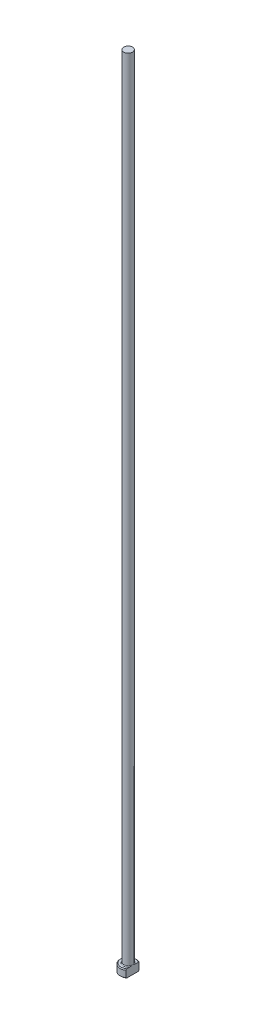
from build123d import *
from build123d.topology import SkipClean

# Parameters (mm, degrees)
CHAMFER1_SIZE = 0.2
FILLET1_R     = 0.2
KEY_DEPTH     = 201.019999


with BuildPart() as part:
    # Sketch1 → Revolve1 (revolve)
    with BuildSketch(Plane.XY, mode=Mode.PRIVATE) as revolve1_sk:
        Polygon((0, 0), (-2, 0), (-2, 2), (-1.1, 2), (-1.1, 200), (0, 200), align=None)
    revolve(revolve1_sk.sketch.rotate(Axis((0, 259.958771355, 0), (0, -1, 0)), 270), axis=Axis((0, 259.958771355, 0), (0, -1, 0)))

    # Chamfer1
    chamfer1_edges = [part.edges().sort_by_distance(p)[0] for p in [
        (0, 2, -2),
        (0, 0, -2),
    ]]
    chamfer(chamfer1_edges, length=CHAMFER1_SIZE)

    # Fillet1
    fillet1_edges = [part.edges().sort_by_distance(p)[0] for p in [
        (0, 2, -1.1),
    ]]
    fillet(fillet1_edges, radius=FILLET1_R)

    # Sketch2 → KEY (cut, through all)
    with SkipClean():  # the faces are left unmerged after this step: merging them gives an invalid solid
        with BuildSketch(Plane(origin=(0, 0, 0), x_dir=(1, 0, 0), z_dir=(0, 1, 0))):
            with BuildLine():
                Line((1.1, 1.670329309), (1.1, -1.670329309))
                ThreePointArc((1.1, -1.670329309), (2, 0), (1.1, 1.670329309))
            make_face()
        extrude(amount=KEY_DEPTH, mode=Mode.SUBTRACT)


solid = part.part
